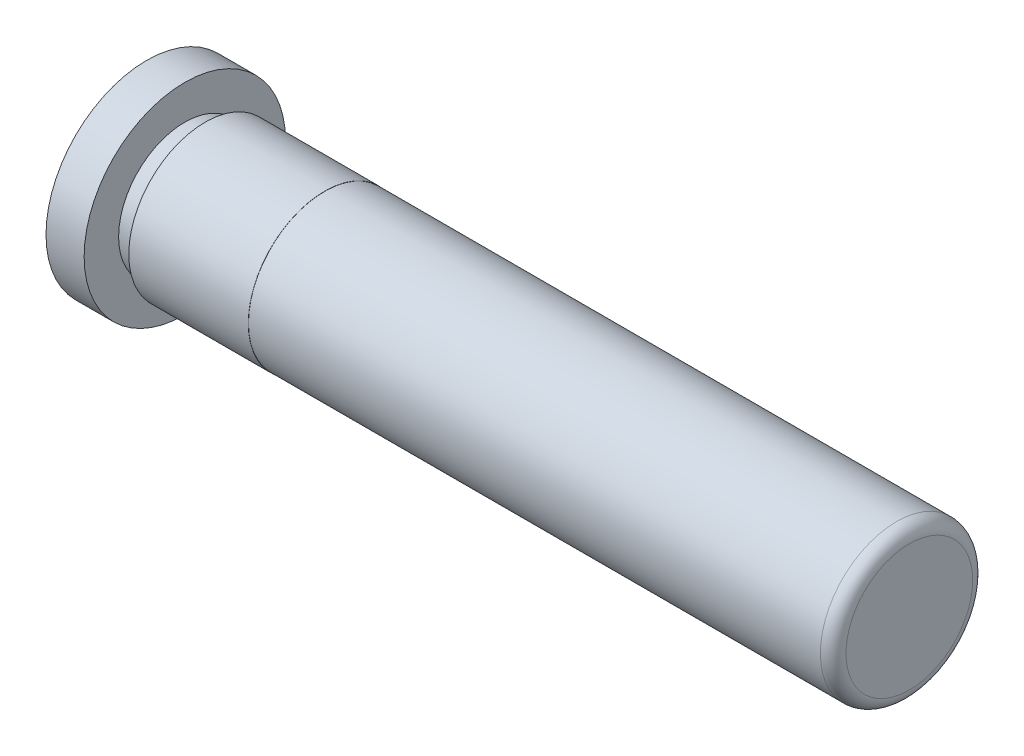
from build123d import *

# Parameters (mm, degrees)
FILLET1_R = 1.6002


with BuildPart() as part:
    # Sketch1 → Leader Pin (revolve)
    with BuildSketch(Plane.XY, mode=Mode.PRIVATE) as leader_pin_sk:
        Polygon((2.54, 9.525), (17.4625, 9.525), (17.4625, 9.4996), (90.4875, 9.4996), (90.4875, -0.0127), (-4.7625, -0.0127), (-4.7625, 12.5603), (0, 12.5603), (0, 8.255), (2.54, 8.255), align=None)
    revolve(leader_pin_sk.sketch.rotate(Axis((-4.7625, -0.0127, 0), (1, 0, 0)), 90), axis=Axis((-4.7625, -0.0127, 0), (1, 0, 0)))

    # Fillet1
    fillet1_edges = [part.edges().sort_by_distance(p)[0] for p in [
        (90.4875, -0.0127, -9.5123),
    ]]
    fillet(fillet1_edges, radius=FILLET1_R)


solid = part.part
